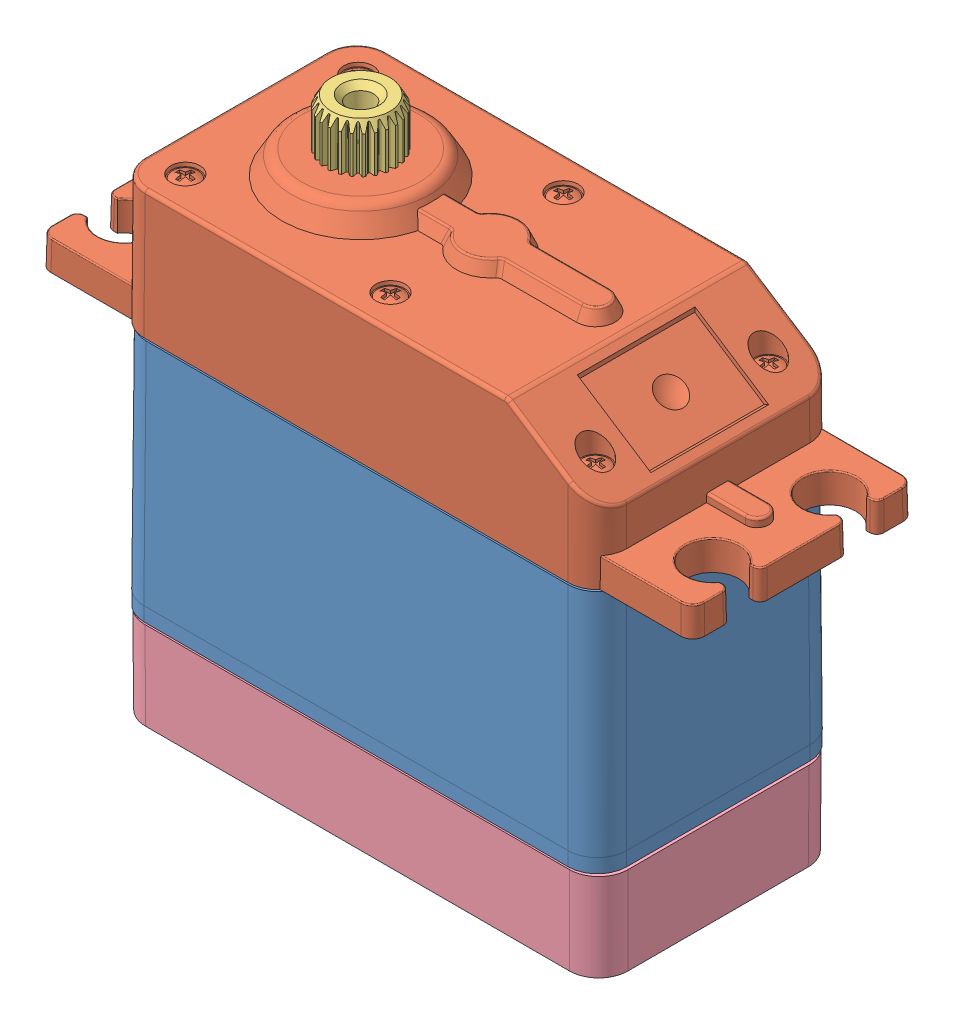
SolidWorks assembly SR431外观.SLDASM, configuration 默认 (file format 15000). Lengths in mm.
Overall size (55.9 52.75 20.7).
6 component instances, 4 part files, 0 mates.
Components (placement in the parent):
- 431_ASM_21_ASM-1: 431_ASM_21_ASM.SLDASM [默认] at origin size (55.9 52.75 20.7)
  - MIDDLE-SHELL_2-1: MIDDLE-SHELL_2.SLDPRT [默认] at origin size (41.3 20.8 20.7)
  - UPPER-SHELL_2-1: UPPER-SHELL_2.SLDPRT [默认] at (0 19.85 0) size (55.9 12.95 20.7)
  - FIVE-STAGE-GEAR_ASM_1_ASM-1: FIVE-STAGE-GEAR_ASM_1_ASM.SLDASM [默认] at (-9.95 26.55 0) x (0 -1 0) z (-0.029666 0 0.99956) size (5 5.96 5.95)
    - FIVE-STAGE-GEAR_2-1: FIVE-STAGE-GEAR_2.SLDPRT [默认] x (0 0 -1) z (-1 0 0) size (5.95 5.96 5)
  - 430-431-HUO-GAI_4-1: 430-431-HUO-GAI_4.SLDPRT [默认] at (0 16.7 0) size (41.33 16.25 20.5)
